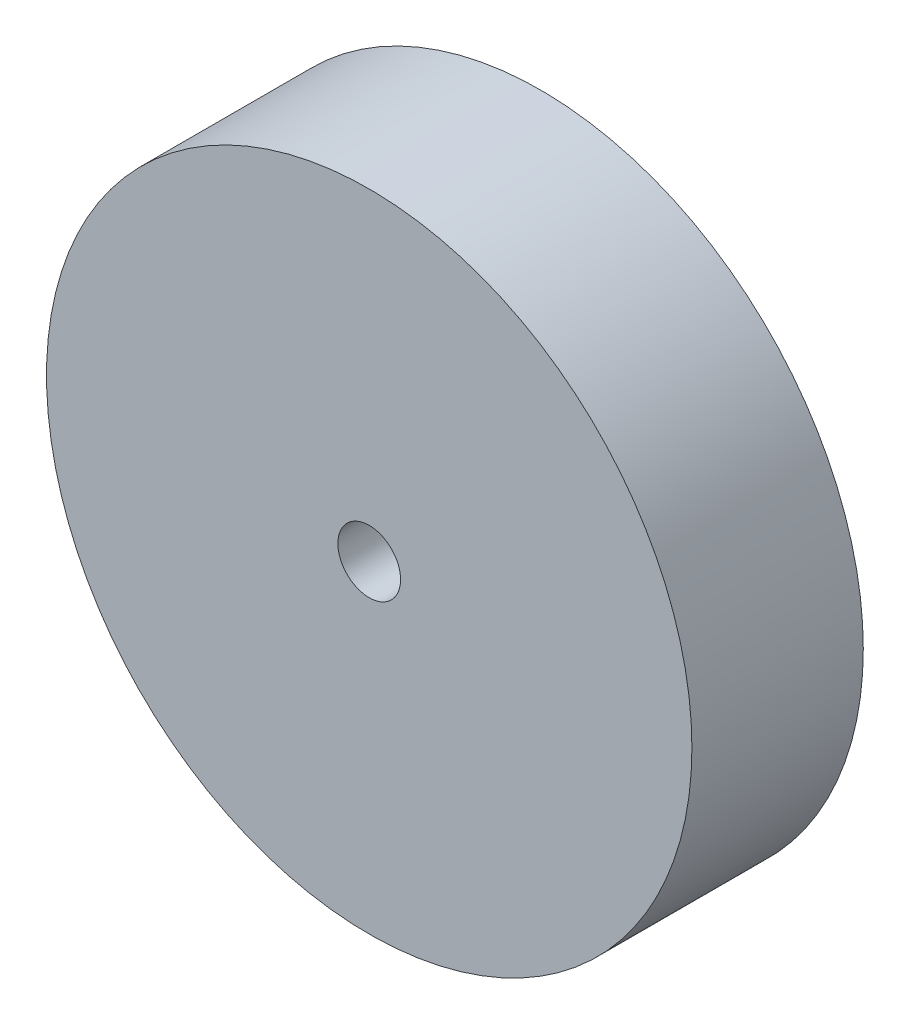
from build123d import *

# Parameters (mm, degrees)
SKETCH1_R           = 3.86
SKETCH1_R_2         = 0.375
BOSS_EXTRUDE1_DEPTH = 2.05


with BuildPart() as part:
    # Sketch1 → Boss-Extrude1 (new body)
    with BuildSketch(Plane.XY):
        Circle(SKETCH1_R)
        Circle(SKETCH1_R_2, mode=Mode.SUBTRACT)
    extrude(amount=BOSS_EXTRUDE1_DEPTH)


solid = part.part
